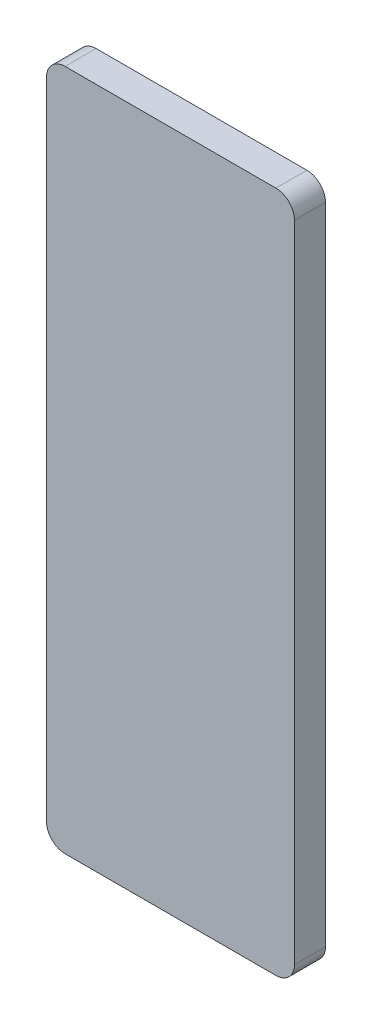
ISO-10303-21;
HEADER;
FILE_DESCRIPTION(('STEP AP214'),'2;1');
FILE_NAME('part.step','',(''),(''),'','','');
FILE_SCHEMA(('AUTOMOTIVE_DESIGN { 1 0 10303 214 1 1 1 1 }'));
ENDSEC;
DATA;
#1=APPLICATION_CONTEXT('core data for automotive mechanical design processes');
#2=APPLICATION_PROTOCOL_DEFINITION('international standard','automotive_design',2000,#1);
#3=PRODUCT_CONTEXT('',#1,'mechanical');
#4=PRODUCT('Part','Part','',(#3));
#5=PRODUCT_RELATED_PRODUCT_CATEGORY('part','',(#4));
#6=PRODUCT_DEFINITION_FORMATION('','',#4);
#7=PRODUCT_DEFINITION_CONTEXT('part definition',#1,'design');
#8=PRODUCT_DEFINITION('design','',#6,#7);
#9=PRODUCT_DEFINITION_SHAPE('','',#8);
#10=(LENGTH_UNIT() NAMED_UNIT(*) SI_UNIT(.MILLI.,.METRE.));
#11=(NAMED_UNIT(*) PLANE_ANGLE_UNIT() SI_UNIT($,.RADIAN.));
#12=(NAMED_UNIT(*) SI_UNIT($,.STERADIAN.) SOLID_ANGLE_UNIT());
#13=UNCERTAINTY_MEASURE_WITH_UNIT(LENGTH_MEASURE(1.E-05),#10,'distance_accuracy_value','');
#14=(GEOMETRIC_REPRESENTATION_CONTEXT(3) GLOBAL_UNCERTAINTY_ASSIGNED_CONTEXT((#13)) GLOBAL_UNIT_ASSIGNED_CONTEXT((#10,
#11,#12)) REPRESENTATION_CONTEXT('',''));
#15=CARTESIAN_POINT('',(0.,0.,0.));
#16=DIRECTION('',(0.,0.,1.));
#17=DIRECTION('',(1.,0.,0.));
#18=AXIS2_PLACEMENT_3D('',#15,#16,#17);
#19=CARTESIAN_POINT('',(-20.,-55.,2.5));
#20=DIRECTION('',(1.,0.,0.));
#21=DIRECTION('',(0.,0.,-1.));
#22=AXIS2_PLACEMENT_3D('',#19,#20,#21);
#23=PLANE('',#22);
#24=DIRECTION('',(0.,-1.,0.));
#25=VECTOR('',#24,1.);
#26=CARTESIAN_POINT('',(-20.,-55.,-2.5));
#27=LINE('',#26,#25);
#28=CARTESIAN_POINT('',(-20.,52.,-2.5));
#29=VERTEX_POINT('',#28);
#30=CARTESIAN_POINT('',(-20.,-52.,-2.5));
#31=VERTEX_POINT('',#30);
#32=EDGE_CURVE('E126',#29,#31,#27,.T.);
#33=ORIENTED_EDGE('',*,*,#32,.T.);
#34=DIRECTION('',(0.,0.,-1.));
#35=VECTOR('',#34,1.);
#36=CARTESIAN_POINT('',(-20.,-52.,2.5));
#37=LINE('',#36,#35);
#38=CARTESIAN_POINT('',(-20.,-52.,2.5));
#39=VERTEX_POINT('',#38);
#40=EDGE_CURVE('E104',#31,#39,#37,.F.);
#41=ORIENTED_EDGE('',*,*,#40,.T.);
#42=DIRECTION('',(0.,-1.,0.));
#43=VECTOR('',#42,1.);
#44=CARTESIAN_POINT('',(-20.,-55.,2.5));
#45=LINE('',#44,#43);
#46=CARTESIAN_POINT('',(-20.,52.,2.5));
#47=VERTEX_POINT('',#46);
#48=EDGE_CURVE('E135',#47,#39,#45,.T.);
#49=ORIENTED_EDGE('',*,*,#48,.F.);
#50=DIRECTION('',(0.,0.,-1.));
#51=VECTOR('',#50,1.);
#52=CARTESIAN_POINT('',(-20.,52.,2.5));
#53=LINE('',#52,#51);
#54=EDGE_CURVE('E109',#47,#29,#53,.T.);
#55=ORIENTED_EDGE('',*,*,#54,.T.);
#56=EDGE_LOOP('',(#33,#41,#49,#55));
#57=FACE_BOUND('',#56,.T.);
#58=ADVANCED_FACE('F33',(#57),#23,.F.);
#59=CARTESIAN_POINT('',(20.,-55.,2.5));
#60=DIRECTION('',(0.,1.,0.));
#61=DIRECTION('',(0.,0.,1.));
#62=AXIS2_PLACEMENT_3D('',#59,#60,#61);
#63=PLANE('',#62);
#64=DIRECTION('',(1.,0.,0.));
#65=VECTOR('',#64,1.);
#66=CARTESIAN_POINT('',(20.,-55.,2.5));
#67=LINE('',#66,#65);
#68=CARTESIAN_POINT('',(-17.,-55.,2.5));
#69=VERTEX_POINT('',#68);
#70=CARTESIAN_POINT('',(17.,-55.,2.5));
#71=VERTEX_POINT('',#70);
#72=EDGE_CURVE('E119',#69,#71,#67,.T.);
#73=ORIENTED_EDGE('',*,*,#72,.F.);
#74=DIRECTION('',(0.,0.,-1.));
#75=VECTOR('',#74,1.);
#76=CARTESIAN_POINT('',(-17.,-55.,2.5));
#77=LINE('',#76,#75);
#78=CARTESIAN_POINT('',(-17.,-55.,-2.5));
#79=VERTEX_POINT('',#78);
#80=EDGE_CURVE('E103',#69,#79,#77,.T.);
#81=ORIENTED_EDGE('',*,*,#80,.T.);
#82=DIRECTION('',(1.,0.,0.));
#83=VECTOR('',#82,1.);
#84=CARTESIAN_POINT('',(20.,-55.,-2.5));
#85=LINE('',#84,#83);
#86=CARTESIAN_POINT('',(17.,-55.,-2.5));
#87=VERTEX_POINT('',#86);
#88=EDGE_CURVE('E116',#79,#87,#85,.T.);
#89=ORIENTED_EDGE('',*,*,#88,.T.);
#90=DIRECTION('',(0.,0.,-1.));
#91=VECTOR('',#90,1.);
#92=CARTESIAN_POINT('',(17.,-55.,2.5));
#93=LINE('',#92,#91);
#94=EDGE_CURVE('E121',#87,#71,#93,.F.);
#95=ORIENTED_EDGE('',*,*,#94,.T.);
#96=EDGE_LOOP('',(#73,#81,#89,#95));
#97=FACE_BOUND('',#96,.T.);
#98=ADVANCED_FACE('F115',(#97),#63,.F.);
#99=CARTESIAN_POINT('',(20.,-55.,2.5));
#100=DIRECTION('',(-1.,0.,0.));
#101=DIRECTION('',(0.,0.,1.));
#102=AXIS2_PLACEMENT_3D('',#99,#100,#101);
#103=PLANE('',#102);
#104=DIRECTION('',(0.,1.,0.));
#105=VECTOR('',#104,1.);
#106=CARTESIAN_POINT('',(20.,-55.,2.5));
#107=LINE('',#106,#105);
#108=CARTESIAN_POINT('',(20.,-52.,2.5));
#109=VERTEX_POINT('',#108);
#110=CARTESIAN_POINT('',(20.,52.,2.5));
#111=VERTEX_POINT('',#110);
#112=EDGE_CURVE('E161',#109,#111,#107,.T.);
#113=ORIENTED_EDGE('',*,*,#112,.F.);
#114=DIRECTION('',(0.,0.,-1.));
#115=VECTOR('',#114,1.);
#116=CARTESIAN_POINT('',(20.,-52.,2.5));
#117=LINE('',#116,#115);
#118=CARTESIAN_POINT('',(20.,-52.,-2.5));
#119=VERTEX_POINT('',#118);
#120=EDGE_CURVE('E154',#109,#119,#117,.T.);
#121=ORIENTED_EDGE('',*,*,#120,.T.);
#122=DIRECTION('',(0.,1.,0.));
#123=VECTOR('',#122,1.);
#124=CARTESIAN_POINT('',(20.,-55.,-2.5));
#125=LINE('',#124,#123);
#126=CARTESIAN_POINT('',(20.,52.,-2.5));
#127=VERTEX_POINT('',#126);
#128=EDGE_CURVE('E125',#119,#127,#125,.T.);
#129=ORIENTED_EDGE('',*,*,#128,.T.);
#130=DIRECTION('',(0.,0.,-1.));
#131=VECTOR('',#130,1.);
#132=CARTESIAN_POINT('',(20.,52.,2.5));
#133=LINE('',#132,#131);
#134=EDGE_CURVE('E152',#127,#111,#133,.F.);
#135=ORIENTED_EDGE('',*,*,#134,.T.);
#136=EDGE_LOOP('',(#113,#121,#129,#135));
#137=FACE_BOUND('',#136,.T.);
#138=ADVANCED_FACE('F159',(#137),#103,.F.);
#139=CARTESIAN_POINT('',(20.,55.,2.5));
#140=DIRECTION('',(0.,-1.,0.));
#141=DIRECTION('',(0.,0.,-1.));
#142=AXIS2_PLACEMENT_3D('',#139,#140,#141);
#143=PLANE('',#142);
#144=DIRECTION('',(-1.,0.,0.));
#145=VECTOR('',#144,1.);
#146=CARTESIAN_POINT('',(20.,55.,2.5));
#147=LINE('',#146,#145);
#148=CARTESIAN_POINT('',(17.,55.,2.5));
#149=VERTEX_POINT('',#148);
#150=CARTESIAN_POINT('',(-17.,55.,2.5));
#151=VERTEX_POINT('',#150);
#152=EDGE_CURVE('E136',#149,#151,#147,.T.);
#153=ORIENTED_EDGE('',*,*,#152,.F.);
#154=DIRECTION('',(0.,0.,-1.));
#155=VECTOR('',#154,1.);
#156=CARTESIAN_POINT('',(17.,55.,2.5));
#157=LINE('',#156,#155);
#158=CARTESIAN_POINT('',(17.,55.,-2.5));
#159=VERTEX_POINT('',#158);
#160=EDGE_CURVE('E11',#149,#159,#157,.T.);
#161=ORIENTED_EDGE('',*,*,#160,.T.);
#162=DIRECTION('',(-1.,0.,0.));
#163=VECTOR('',#162,1.);
#164=CARTESIAN_POINT('',(20.,55.,-2.5));
#165=LINE('',#164,#163);
#166=CARTESIAN_POINT('',(-17.,55.,-2.5));
#167=VERTEX_POINT('',#166);
#168=EDGE_CURVE('E129',#159,#167,#165,.T.);
#169=ORIENTED_EDGE('',*,*,#168,.T.);
#170=DIRECTION('',(0.,0.,-1.));
#171=VECTOR('',#170,1.);
#172=CARTESIAN_POINT('',(-17.,55.,2.5));
#173=LINE('',#172,#171);
#174=EDGE_CURVE('E41',#167,#151,#173,.F.);
#175=ORIENTED_EDGE('',*,*,#174,.T.);
#176=EDGE_LOOP('',(#153,#161,#169,#175));
#177=FACE_BOUND('',#176,.T.);
#178=ADVANCED_FACE('F168',(#177),#143,.F.);
#179=CARTESIAN_POINT('',(0.,0.,2.5));
#180=DIRECTION('',(0.,0.,1.));
#181=DIRECTION('',(1.,0.,0.));
#182=AXIS2_PLACEMENT_3D('',#179,#180,#181);
#183=PLANE('',#182);
#184=ORIENTED_EDGE('',*,*,#48,.T.);
#185=CARTESIAN_POINT('',(-17.,-52.,2.5));
#186=DIRECTION('',(0.,0.,1.));
#187=DIRECTION('',(1.,0.,0.));
#188=AXIS2_PLACEMENT_3D('',#185,#186,#187);
#189=CIRCLE('',#188,3.);
#190=EDGE_CURVE('E150',#39,#69,#189,.T.);
#191=ORIENTED_EDGE('',*,*,#190,.T.);
#192=ORIENTED_EDGE('',*,*,#72,.T.);
#193=CARTESIAN_POINT('',(17.,-52.,2.5));
#194=DIRECTION('',(0.,0.,1.));
#195=DIRECTION('',(1.,0.,0.));
#196=AXIS2_PLACEMENT_3D('',#193,#194,#195);
#197=CIRCLE('',#196,3.);
#198=EDGE_CURVE('E148',#71,#109,#197,.T.);
#199=ORIENTED_EDGE('',*,*,#198,.T.);
#200=ORIENTED_EDGE('',*,*,#112,.T.);
#201=CARTESIAN_POINT('',(17.,52.,2.5));
#202=DIRECTION('',(0.,0.,1.));
#203=DIRECTION('',(1.,0.,0.));
#204=AXIS2_PLACEMENT_3D('',#201,#202,#203);
#205=CIRCLE('',#204,3.);
#206=EDGE_CURVE('E54',#111,#149,#205,.T.);
#207=ORIENTED_EDGE('',*,*,#206,.T.);
#208=ORIENTED_EDGE('',*,*,#152,.T.);
#209=CARTESIAN_POINT('',(-17.,52.,2.5));
#210=DIRECTION('',(0.,0.,1.));
#211=DIRECTION('',(1.,0.,0.));
#212=AXIS2_PLACEMENT_3D('',#209,#210,#211);
#213=CIRCLE('',#212,3.);
#214=EDGE_CURVE('E145',#151,#47,#213,.T.);
#215=ORIENTED_EDGE('',*,*,#214,.T.);
#216=EDGE_LOOP('',(#184,#191,#192,#199,#200,#207,#208,#215));
#217=FACE_BOUND('',#216,.T.);
#218=ADVANCED_FACE('F175',(#217),#183,.T.);
#219=CARTESIAN_POINT('',(0.,0.,-2.5));
#220=DIRECTION('',(0.,0.,1.));
#221=DIRECTION('',(1.,0.,0.));
#222=AXIS2_PLACEMENT_3D('',#219,#220,#221);
#223=PLANE('',#222);
#224=ORIENTED_EDGE('',*,*,#88,.F.);
#225=CARTESIAN_POINT('',(-17.,-52.,-2.5));
#226=DIRECTION('',(0.,0.,1.));
#227=DIRECTION('',(1.,0.,0.));
#228=AXIS2_PLACEMENT_3D('',#225,#226,#227);
#229=CIRCLE('',#228,3.);
#230=EDGE_CURVE('E99',#79,#31,#229,.F.);
#231=ORIENTED_EDGE('',*,*,#230,.T.);
#232=ORIENTED_EDGE('',*,*,#32,.F.);
#233=CARTESIAN_POINT('',(-17.,52.,-2.5));
#234=DIRECTION('',(0.,0.,1.));
#235=DIRECTION('',(1.,0.,0.));
#236=AXIS2_PLACEMENT_3D('',#233,#234,#235);
#237=CIRCLE('',#236,3.);
#238=EDGE_CURVE('E120',#29,#167,#237,.F.);
#239=ORIENTED_EDGE('',*,*,#238,.T.);
#240=ORIENTED_EDGE('',*,*,#168,.F.);
#241=CARTESIAN_POINT('',(17.,52.,-2.5));
#242=DIRECTION('',(0.,0.,1.));
#243=DIRECTION('',(1.,0.,0.));
#244=AXIS2_PLACEMENT_3D('',#241,#242,#243);
#245=CIRCLE('',#244,3.);
#246=EDGE_CURVE('E139',#159,#127,#245,.F.);
#247=ORIENTED_EDGE('',*,*,#246,.T.);
#248=ORIENTED_EDGE('',*,*,#128,.F.);
#249=CARTESIAN_POINT('',(17.,-52.,-2.5));
#250=DIRECTION('',(0.,0.,1.));
#251=DIRECTION('',(1.,0.,0.));
#252=AXIS2_PLACEMENT_3D('',#249,#250,#251);
#253=CIRCLE('',#252,3.);
#254=EDGE_CURVE('E110',#119,#87,#253,.F.);
#255=ORIENTED_EDGE('',*,*,#254,.T.);
#256=EDGE_LOOP('',(#224,#231,#232,#239,#240,#247,#248,#255));
#257=FACE_BOUND('',#256,.T.);
#258=ADVANCED_FACE('F123',(#257),#223,.F.);
#259=CARTESIAN_POINT('',(-17.,-52.,2.5));
#260=DIRECTION('',(0.,0.,-1.));
#261=DIRECTION('',(-1.,0.,0.));
#262=AXIS2_PLACEMENT_3D('',#259,#260,#261);
#263=CYLINDRICAL_SURFACE('',#262,3.);
#264=ORIENTED_EDGE('',*,*,#190,.F.);
#265=ORIENTED_EDGE('',*,*,#40,.F.);
#266=ORIENTED_EDGE('',*,*,#230,.F.);
#267=ORIENTED_EDGE('',*,*,#80,.F.);
#268=EDGE_LOOP('',(#264,#265,#266,#267));
#269=FACE_BOUND('',#268,.T.);
#270=ADVANCED_FACE('F102',(#269),#263,.T.);
#271=CARTESIAN_POINT('',(17.,-52.,2.5));
#272=DIRECTION('',(0.,0.,-1.));
#273=DIRECTION('',(-1.,0.,0.));
#274=AXIS2_PLACEMENT_3D('',#271,#272,#273);
#275=CYLINDRICAL_SURFACE('',#274,3.);
#276=ORIENTED_EDGE('',*,*,#198,.F.);
#277=ORIENTED_EDGE('',*,*,#94,.F.);
#278=ORIENTED_EDGE('',*,*,#254,.F.);
#279=ORIENTED_EDGE('',*,*,#120,.F.);
#280=EDGE_LOOP('',(#276,#277,#278,#279));
#281=FACE_BOUND('',#280,.T.);
#282=ADVANCED_FACE('F183',(#281),#275,.T.);
#283=CARTESIAN_POINT('',(17.,52.,2.5));
#284=DIRECTION('',(0.,0.,-1.));
#285=DIRECTION('',(-1.,0.,0.));
#286=AXIS2_PLACEMENT_3D('',#283,#284,#285);
#287=CYLINDRICAL_SURFACE('',#286,3.);
#288=ORIENTED_EDGE('',*,*,#206,.F.);
#289=ORIENTED_EDGE('',*,*,#134,.F.);
#290=ORIENTED_EDGE('',*,*,#246,.F.);
#291=ORIENTED_EDGE('',*,*,#160,.F.);
#292=EDGE_LOOP('',(#288,#289,#290,#291));
#293=FACE_BOUND('',#292,.T.);
#294=ADVANCED_FACE('F167',(#293),#287,.T.);
#295=CARTESIAN_POINT('',(-17.,52.,2.5));
#296=DIRECTION('',(0.,0.,-1.));
#297=DIRECTION('',(-1.,0.,0.));
#298=AXIS2_PLACEMENT_3D('',#295,#296,#297);
#299=CYLINDRICAL_SURFACE('',#298,3.);
#300=ORIENTED_EDGE('',*,*,#214,.F.);
#301=ORIENTED_EDGE('',*,*,#174,.F.);
#302=ORIENTED_EDGE('',*,*,#238,.F.);
#303=ORIENTED_EDGE('',*,*,#54,.F.);
#304=EDGE_LOOP('',(#300,#301,#302,#303));
#305=FACE_BOUND('',#304,.T.);
#306=ADVANCED_FACE('F35',(#305),#299,.T.);
#307=CLOSED_SHELL('',(#58,#98,#138,#178,#218,#258,#270,#282,#294,#306));
#308=MANIFOLD_SOLID_BREP('B2',#307);
#309=ADVANCED_BREP_SHAPE_REPRESENTATION('',(#18,#308),#14);
#310=SHAPE_DEFINITION_REPRESENTATION(#9,#309);
ENDSEC;
END-ISO-10303-21;
